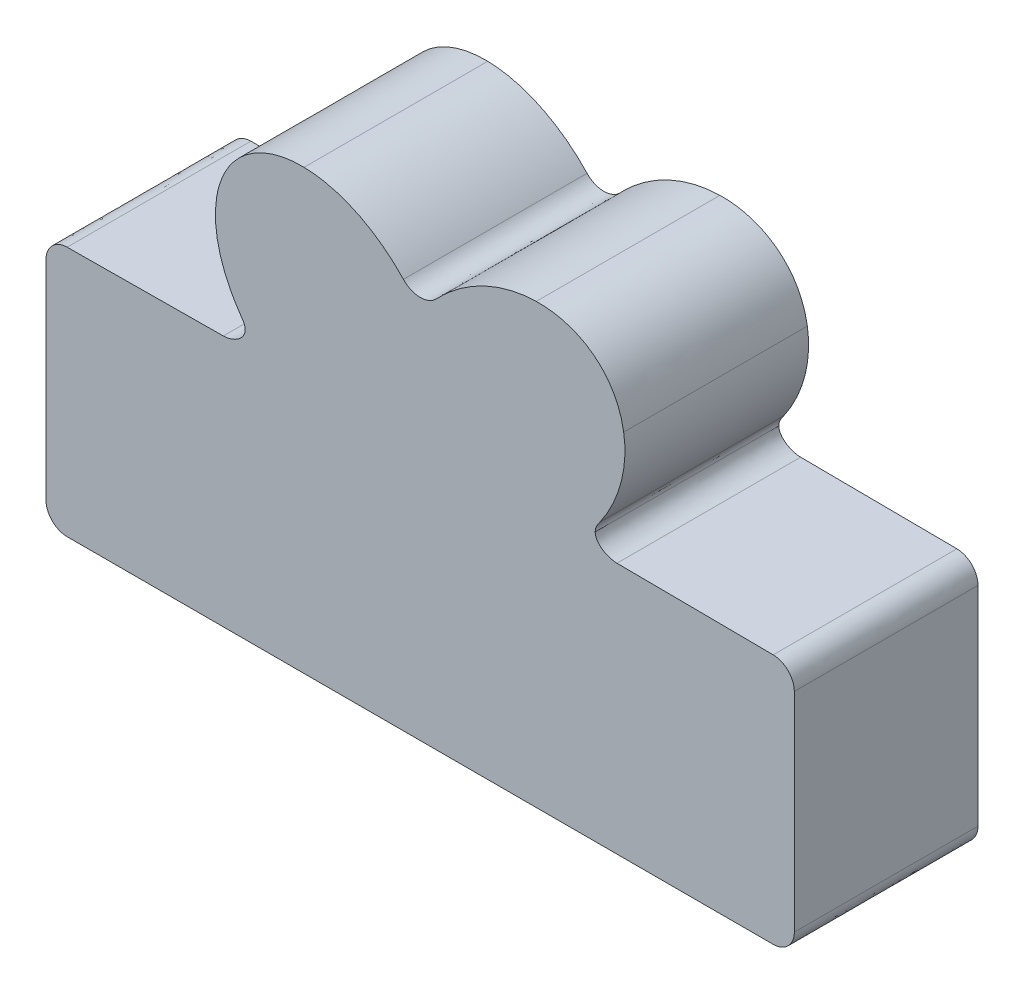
ISO-10303-21;
HEADER;
FILE_DESCRIPTION(('STEP AP214'),'2;1');
FILE_NAME('part.step','',(''),(''),'','','');
FILE_SCHEMA(('AUTOMOTIVE_DESIGN { 1 0 10303 214 1 1 1 1 }'));
ENDSEC;
DATA;
#1=APPLICATION_CONTEXT('core data for automotive mechanical design processes');
#2=APPLICATION_PROTOCOL_DEFINITION('international standard','automotive_design',2000,#1);
#3=PRODUCT_CONTEXT('',#1,'mechanical');
#4=PRODUCT('Part','Part','',(#3));
#5=PRODUCT_RELATED_PRODUCT_CATEGORY('part','',(#4));
#6=PRODUCT_DEFINITION_FORMATION('','',#4);
#7=PRODUCT_DEFINITION_CONTEXT('part definition',#1,'design');
#8=PRODUCT_DEFINITION('design','',#6,#7);
#9=PRODUCT_DEFINITION_SHAPE('','',#8);
#10=(LENGTH_UNIT() NAMED_UNIT(*) SI_UNIT(.MILLI.,.METRE.));
#11=(NAMED_UNIT(*) PLANE_ANGLE_UNIT() SI_UNIT($,.RADIAN.));
#12=(NAMED_UNIT(*) SI_UNIT($,.STERADIAN.) SOLID_ANGLE_UNIT());
#13=UNCERTAINTY_MEASURE_WITH_UNIT(LENGTH_MEASURE(1.E-05),#10,'distance_accuracy_value','');
#14=(GEOMETRIC_REPRESENTATION_CONTEXT(3) GLOBAL_UNCERTAINTY_ASSIGNED_CONTEXT((#13)) GLOBAL_UNIT_ASSIGNED_CONTEXT((#10,
#11,#12)) REPRESENTATION_CONTEXT('',''));
#15=CARTESIAN_POINT('',(0.,0.,0.));
#16=DIRECTION('',(0.,0.,1.));
#17=DIRECTION('',(1.,0.,0.));
#18=AXIS2_PLACEMENT_3D('',#15,#16,#17);
#19=CARTESIAN_POINT('',(569.775998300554,314.705898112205,8.));
#20=CARTESIAN_POINT('',(569.467398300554,316.625398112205,8.));
#21=CARTESIAN_POINT('',(567.892498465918,317.773697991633,8.));
#22=CARTESIAN_POINT('',(565.96789870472,317.733798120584,8.));
#23=B_SPLINE_CURVE_WITH_KNOTS('',3,(#19,#20,#21,#22),.UNSPECIFIED.,.F.,.F.,(4,4),
(0.904761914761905,1.),.UNSPECIFIED.);
#24=DIRECTION('',(0.,0.,-1.));
#25=VECTOR('',#24,1.);
#26=SURFACE_OF_LINEAR_EXTRUSION('',#23,#25);
#27=CARTESIAN_POINT('',(569.775998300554,314.705898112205,0.));
#28=CARTESIAN_POINT('',(569.467398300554,316.625398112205,0.));
#29=CARTESIAN_POINT('',(567.892498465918,317.773697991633,0.));
#30=CARTESIAN_POINT('',(565.96789870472,317.733798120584,0.));
#31=B_SPLINE_CURVE_WITH_KNOTS('',3,(#27,#28,#29,#30),.UNSPECIFIED.,.F.,.F.,(4,4),
(0.904761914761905,1.),.UNSPECIFIED.);
#32=CARTESIAN_POINT('',(569.775998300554,314.705898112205,0.));
#33=VERTEX_POINT('',#32);
#34=CARTESIAN_POINT('',(565.96789870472,317.733798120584,0.));
#35=VERTEX_POINT('',#34);
#36=EDGE_CURVE('E407',#33,#35,#31,.T.);
#37=ORIENTED_EDGE('',*,*,#36,.T.);
#38=DIRECTION('',(0.,0.,-1.));
#39=VECTOR('',#38,1.);
#40=CARTESIAN_POINT('',(565.96789870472,317.733798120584,8.));
#41=LINE('',#40,#39);
#42=CARTESIAN_POINT('',(565.96789870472,317.733798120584,8.));
#43=VERTEX_POINT('',#42);
#44=EDGE_CURVE('E11',#43,#35,#41,.T.);
#45=ORIENTED_EDGE('',*,*,#44,.F.);
#46=CARTESIAN_POINT('',(569.775998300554,314.705898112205,8.));
#47=VERTEX_POINT('',#46);
#48=EDGE_CURVE('E383',#47,#43,#23,.T.);
#49=ORIENTED_EDGE('',*,*,#48,.F.);
#50=DIRECTION('',(0.,0.,-1.));
#51=VECTOR('',#50,1.);
#52=CARTESIAN_POINT('',(569.775998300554,314.705898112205,8.));
#53=LINE('',#52,#51);
#54=EDGE_CURVE('E200',#47,#33,#53,.T.);
#55=ORIENTED_EDGE('',*,*,#54,.T.);
#56=EDGE_LOOP('',(#37,#45,#49,#55));
#57=FACE_BOUND('',#56,.T.);
#58=ADVANCED_FACE('F35',(#57),#26,.F.);
#59=CARTESIAN_POINT('',(565.96789870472,317.733798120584,8.));
#60=CARTESIAN_POINT('',(564.32079870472,317.699698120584,8.));
#61=CARTESIAN_POINT('',(562.752599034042,316.857598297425,8.));
#62=CARTESIAN_POINT('',(561.64059917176,315.673098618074,8.));
#63=B_SPLINE_CURVE_WITH_KNOTS('',3,(#59,#60,#61,#62),.UNSPECIFIED.,.F.,.F.,(4,4),
(0.857142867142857,0.904761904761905),.UNSPECIFIED.);
#64=DIRECTION('',(0.,0.,-1.));
#65=VECTOR('',#64,1.);
#66=SURFACE_OF_LINEAR_EXTRUSION('',#63,#65);
#67=CARTESIAN_POINT('',(565.96789870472,317.733798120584,0.));
#68=CARTESIAN_POINT('',(564.32079870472,317.699698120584,0.));
#69=CARTESIAN_POINT('',(562.752599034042,316.857598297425,0.));
#70=CARTESIAN_POINT('',(561.64059917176,315.673098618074,0.));
#71=B_SPLINE_CURVE_WITH_KNOTS('',3,(#67,#68,#69,#70),.UNSPECIFIED.,.F.,.F.,(4,4),
(0.857142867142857,0.904761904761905),.UNSPECIFIED.);
#72=CARTESIAN_POINT('',(561.64059917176,315.673098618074,0.));
#73=VERTEX_POINT('',#72);
#74=EDGE_CURVE('E398',#35,#73,#71,.T.);
#75=ORIENTED_EDGE('',*,*,#74,.T.);
#76=DIRECTION('',(0.,0.,-1.));
#77=VECTOR('',#76,1.);
#78=CARTESIAN_POINT('',(561.64059917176,315.673098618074,8.));
#79=LINE('',#78,#77);
#80=CARTESIAN_POINT('',(561.64059917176,315.673098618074,8.));
#81=VERTEX_POINT('',#80);
#82=EDGE_CURVE('E44',#81,#73,#79,.T.);
#83=ORIENTED_EDGE('',*,*,#82,.F.);
#84=EDGE_CURVE('E131',#43,#81,#63,.T.);
#85=ORIENTED_EDGE('',*,*,#84,.F.);
#86=ORIENTED_EDGE('',*,*,#44,.T.);
#87=EDGE_LOOP('',(#75,#83,#85,#86));
#88=FACE_BOUND('',#87,.T.);
#89=ADVANCED_FACE('F390',(#88),#66,.F.);
#90=CARTESIAN_POINT('',(561.64059917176,315.673098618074,8.));
#91=CARTESIAN_POINT('',(561.24549917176,315.251798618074,8.));
#92=CARTESIAN_POINT('',(560.577099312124,315.251798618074,8.));
#93=CARTESIAN_POINT('',(560.181999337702,315.673098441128,8.));
#94=B_SPLINE_CURVE_WITH_KNOTS('',3,(#90,#91,#92,#93),.UNSPECIFIED.,.F.,.F.,(4,4),
(0.80952381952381,0.857142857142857),.UNSPECIFIED.);
#95=DIRECTION('',(0.,0.,-1.));
#96=VECTOR('',#95,1.);
#97=SURFACE_OF_LINEAR_EXTRUSION('',#94,#96);
#98=CARTESIAN_POINT('',(561.64059917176,315.673098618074,0.));
#99=CARTESIAN_POINT('',(561.24549917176,315.251798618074,0.));
#100=CARTESIAN_POINT('',(560.577099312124,315.251798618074,0.));
#101=CARTESIAN_POINT('',(560.181999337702,315.673098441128,0.));
#102=B_SPLINE_CURVE_WITH_KNOTS('',3,(#98,#99,#100,#101),.UNSPECIFIED.,.F.,.F.,(4,4),
(0.80952381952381,0.857142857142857),.UNSPECIFIED.);
#103=CARTESIAN_POINT('',(560.181999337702,315.673098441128,0.));
#104=VERTEX_POINT('',#103);
#105=EDGE_CURVE('E406',#73,#104,#102,.T.);
#106=ORIENTED_EDGE('',*,*,#105,.T.);
#107=DIRECTION('',(0.,0.,-1.));
#108=VECTOR('',#107,1.);
#109=CARTESIAN_POINT('',(560.181999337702,315.673098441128,8.));
#110=LINE('',#109,#108);
#111=CARTESIAN_POINT('',(560.181999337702,315.673098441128,8.));
#112=VERTEX_POINT('',#111);
#113=EDGE_CURVE('E411',#112,#104,#110,.T.);
#114=ORIENTED_EDGE('',*,*,#113,.F.);
#115=EDGE_CURVE('E369',#81,#112,#94,.T.);
#116=ORIENTED_EDGE('',*,*,#115,.F.);
#117=ORIENTED_EDGE('',*,*,#82,.T.);
#118=EDGE_LOOP('',(#106,#114,#116,#117));
#119=FACE_BOUND('',#118,.T.);
#120=ADVANCED_FACE('F362',(#119),#97,.F.);
#121=CARTESIAN_POINT('',(560.181999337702,315.673098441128,8.));
#122=CARTESIAN_POINT('',(559.069999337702,316.857598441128,8.));
#123=CARTESIAN_POINT('',(557.501799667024,317.699698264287,8.));
#124=CARTESIAN_POINT('',(555.854700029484,317.733798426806,8.));
#125=B_SPLINE_CURVE_WITH_KNOTS('',3,(#121,#122,#123,#124),.UNSPECIFIED.,.F.,.F.,(4,4),
(0.761904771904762,0.80952380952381),.UNSPECIFIED.);
#126=DIRECTION('',(0.,0.,-1.));
#127=VECTOR('',#126,1.);
#128=SURFACE_OF_LINEAR_EXTRUSION('',#125,#127);
#129=CARTESIAN_POINT('',(560.181999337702,315.673098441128,0.));
#130=CARTESIAN_POINT('',(559.069999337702,316.857598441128,0.));
#131=CARTESIAN_POINT('',(557.501799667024,317.699698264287,0.));
#132=CARTESIAN_POINT('',(555.854700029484,317.733798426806,0.));
#133=B_SPLINE_CURVE_WITH_KNOTS('',3,(#129,#130,#131,#132),.UNSPECIFIED.,.F.,.F.,(4,4),
(0.761904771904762,0.80952380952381),.UNSPECIFIED.);
#134=CARTESIAN_POINT('',(555.854700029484,317.733798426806,0.));
#135=VERTEX_POINT('',#134);
#136=EDGE_CURVE('E415',#104,#135,#133,.T.);
#137=ORIENTED_EDGE('',*,*,#136,.T.);
#138=DIRECTION('',(0.,0.,-1.));
#139=VECTOR('',#138,1.);
#140=CARTESIAN_POINT('',(555.854700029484,317.733798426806,8.));
#141=LINE('',#140,#139);
#142=CARTESIAN_POINT('',(555.854700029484,317.733798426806,8.));
#143=VERTEX_POINT('',#142);
#144=EDGE_CURVE('E579',#143,#135,#141,.T.);
#145=ORIENTED_EDGE('',*,*,#144,.F.);
#146=EDGE_CURVE('E365',#112,#143,#125,.T.);
#147=ORIENTED_EDGE('',*,*,#146,.F.);
#148=ORIENTED_EDGE('',*,*,#113,.T.);
#149=EDGE_LOOP('',(#137,#145,#147,#148));
#150=FACE_BOUND('',#149,.T.);
#151=ADVANCED_FACE('F358',(#150),#128,.F.);
#152=CARTESIAN_POINT('',(555.854700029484,317.733798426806,8.));
#153=CARTESIAN_POINT('',(553.930100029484,317.773698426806,8.));
#154=CARTESIAN_POINT('',(552.355200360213,316.625398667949,8.));
#155=CARTESIAN_POINT('',(552.046600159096,314.705899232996,8.));
#156=B_SPLINE_CURVE_WITH_KNOTS('',3,(#152,#153,#154,#155),.UNSPECIFIED.,.F.,.F.,(4,4),
(0.714285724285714,0.761904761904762),.UNSPECIFIED.);
#157=DIRECTION('',(0.,0.,-1.));
#158=VECTOR('',#157,1.);
#159=SURFACE_OF_LINEAR_EXTRUSION('',#156,#158);
#160=CARTESIAN_POINT('',(555.854700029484,317.733798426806,0.));
#161=CARTESIAN_POINT('',(553.930100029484,317.773698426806,0.));
#162=CARTESIAN_POINT('',(552.355200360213,316.625398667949,0.));
#163=CARTESIAN_POINT('',(552.046600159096,314.705899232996,0.));
#164=B_SPLINE_CURVE_WITH_KNOTS('',3,(#160,#161,#162,#163),.UNSPECIFIED.,.F.,.F.,(4,4),
(0.714285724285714,0.761904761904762),.UNSPECIFIED.);
#165=CARTESIAN_POINT('',(552.046600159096,314.705899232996,0.));
#166=VERTEX_POINT('',#165);
#167=EDGE_CURVE('E417',#135,#166,#164,.T.);
#168=ORIENTED_EDGE('',*,*,#167,.T.);
#169=DIRECTION('',(0.,0.,-1.));
#170=VECTOR('',#169,1.);
#171=CARTESIAN_POINT('',(552.046600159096,314.705899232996,8.));
#172=LINE('',#171,#170);
#173=CARTESIAN_POINT('',(552.046600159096,314.705899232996,8.));
#174=VERTEX_POINT('',#173);
#175=EDGE_CURVE('E576',#174,#166,#172,.T.);
#176=ORIENTED_EDGE('',*,*,#175,.F.);
#177=EDGE_CURVE('E343',#143,#174,#156,.T.);
#178=ORIENTED_EDGE('',*,*,#177,.F.);
#179=ORIENTED_EDGE('',*,*,#144,.T.);
#180=EDGE_LOOP('',(#168,#176,#178,#179));
#181=FACE_BOUND('',#180,.T.);
#182=ADVANCED_FACE('F354',(#181),#159,.F.);
#183=CARTESIAN_POINT('',(552.046600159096,314.705899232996,8.));
#184=CARTESIAN_POINT('',(551.826200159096,313.334899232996,8.));
#185=CARTESIAN_POINT('',(552.296700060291,311.915599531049,8.));
#186=CARTESIAN_POINT('',(553.081599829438,310.79589970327,8.));
#187=B_SPLINE_CURVE_WITH_KNOTS('',3,(#183,#184,#185,#186),.UNSPECIFIED.,.F.,.F.,(4,4),
(0.666666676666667,0.714285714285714),.UNSPECIFIED.);
#188=DIRECTION('',(0.,0.,-1.));
#189=VECTOR('',#188,1.);
#190=SURFACE_OF_LINEAR_EXTRUSION('',#187,#189);
#191=CARTESIAN_POINT('',(552.046600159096,314.705899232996,0.));
#192=CARTESIAN_POINT('',(551.826200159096,313.334899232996,0.));
#193=CARTESIAN_POINT('',(552.296700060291,311.915599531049,0.));
#194=CARTESIAN_POINT('',(553.081599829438,310.79589970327,0.));
#195=B_SPLINE_CURVE_WITH_KNOTS('',3,(#191,#192,#193,#194),.UNSPECIFIED.,.F.,.F.,(4,4),
(0.666666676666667,0.714285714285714),.UNSPECIFIED.);
#196=CARTESIAN_POINT('',(553.081599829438,310.79589970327,0.));
#197=VERTEX_POINT('',#196);
#198=EDGE_CURVE('E435',#166,#197,#195,.T.);
#199=ORIENTED_EDGE('',*,*,#198,.T.);
#200=DIRECTION('',(0.,0.,-1.));
#201=VECTOR('',#200,1.);
#202=CARTESIAN_POINT('',(553.081599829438,310.79589970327,8.));
#203=LINE('',#202,#201);
#204=CARTESIAN_POINT('',(553.081599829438,310.79589970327,8.));
#205=VERTEX_POINT('',#204);
#206=EDGE_CURVE('E573',#205,#197,#203,.T.);
#207=ORIENTED_EDGE('',*,*,#206,.F.);
#208=EDGE_CURVE('E335',#174,#205,#187,.T.);
#209=ORIENTED_EDGE('',*,*,#208,.F.);
#210=ORIENTED_EDGE('',*,*,#175,.T.);
#211=EDGE_LOOP('',(#199,#207,#209,#210));
#212=FACE_BOUND('',#211,.T.);
#213=ADVANCED_FACE('F351',(#212),#190,.F.);
#214=CARTESIAN_POINT('',(553.081599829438,310.79589970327,8.));
#215=CARTESIAN_POINT('',(553.187999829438,310.64399970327,8.));
#216=CARTESIAN_POINT('',(553.288499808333,310.51899972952,8.));
#217=CARTESIAN_POINT('',(553.287499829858,310.321799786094,8.));
#218=B_SPLINE_CURVE_WITH_KNOTS('',3,(#214,#215,#216,#217),.UNSPECIFIED.,.F.,.F.,(4,4),
(0.619047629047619,0.666666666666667),.UNSPECIFIED.);
#219=DIRECTION('',(0.,0.,-1.));
#220=VECTOR('',#219,1.);
#221=SURFACE_OF_LINEAR_EXTRUSION('',#218,#220);
#222=CARTESIAN_POINT('',(553.081599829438,310.79589970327,0.));
#223=CARTESIAN_POINT('',(553.187999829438,310.64399970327,0.));
#224=CARTESIAN_POINT('',(553.288499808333,310.51899972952,0.));
#225=CARTESIAN_POINT('',(553.287499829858,310.321799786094,0.));
#226=B_SPLINE_CURVE_WITH_KNOTS('',3,(#222,#223,#224,#225),.UNSPECIFIED.,.F.,.F.,(4,4),
(0.619047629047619,0.666666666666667),.UNSPECIFIED.);
#227=CARTESIAN_POINT('',(553.287499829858,310.321799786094,0.));
#228=VERTEX_POINT('',#227);
#229=EDGE_CURVE('E442',#197,#228,#226,.T.);
#230=ORIENTED_EDGE('',*,*,#229,.T.);
#231=DIRECTION('',(0.,0.,-1.));
#232=VECTOR('',#231,1.);
#233=CARTESIAN_POINT('',(553.287499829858,310.321799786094,8.));
#234=LINE('',#233,#232);
#235=CARTESIAN_POINT('',(553.287499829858,310.321799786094,8.));
#236=VERTEX_POINT('',#235);
#237=EDGE_CURVE('E570',#236,#228,#234,.T.);
#238=ORIENTED_EDGE('',*,*,#237,.F.);
#239=EDGE_CURVE('E327',#205,#236,#218,.T.);
#240=ORIENTED_EDGE('',*,*,#239,.F.);
#241=ORIENTED_EDGE('',*,*,#206,.T.);
#242=EDGE_LOOP('',(#230,#238,#240,#241));
#243=FACE_BOUND('',#242,.T.);
#244=ADVANCED_FACE('F319',(#243),#221,.F.);
#245=CARTESIAN_POINT('',(553.287499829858,310.321799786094,8.));
#246=CARTESIAN_POINT('',(553.285099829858,309.902299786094,8.));
#247=CARTESIAN_POINT('',(552.744599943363,309.617599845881,8.));
#248=CARTESIAN_POINT('',(552.3395,309.614599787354,8.));
#249=B_SPLINE_CURVE_WITH_KNOTS('',3,(#245,#246,#247,#248),.UNSPECIFIED.,.F.,.F.,(4,4),
(0.571428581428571,0.619047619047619),.UNSPECIFIED.);
#250=DIRECTION('',(0.,0.,-1.));
#251=VECTOR('',#250,1.);
#252=SURFACE_OF_LINEAR_EXTRUSION('',#249,#251);
#253=CARTESIAN_POINT('',(553.287499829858,310.321799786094,0.));
#254=CARTESIAN_POINT('',(553.285099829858,309.902299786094,0.));
#255=CARTESIAN_POINT('',(552.744599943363,309.617599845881,0.));
#256=CARTESIAN_POINT('',(552.3395,309.614599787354,0.));
#257=B_SPLINE_CURVE_WITH_KNOTS('',3,(#253,#254,#255,#256),.UNSPECIFIED.,.F.,.F.,(4,4),
(0.571428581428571,0.619047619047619),.UNSPECIFIED.);
#258=CARTESIAN_POINT('',(552.3395,309.614599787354,0.));
#259=VERTEX_POINT('',#258);
#260=EDGE_CURVE('E449',#228,#259,#257,.T.);
#261=ORIENTED_EDGE('',*,*,#260,.T.);
#262=DIRECTION('',(0.,0.,-1.));
#263=VECTOR('',#262,1.);
#264=CARTESIAN_POINT('',(552.3395,309.614599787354,8.));
#265=LINE('',#264,#263);
#266=CARTESIAN_POINT('',(552.3395,309.614599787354,8.));
#267=VERTEX_POINT('',#266);
#268=EDGE_CURVE('E567',#267,#259,#265,.T.);
#269=ORIENTED_EDGE('',*,*,#268,.F.);
#270=EDGE_CURVE('E323',#236,#267,#249,.T.);
#271=ORIENTED_EDGE('',*,*,#270,.F.);
#272=ORIENTED_EDGE('',*,*,#237,.T.);
#273=EDGE_LOOP('',(#261,#269,#271,#272));
#274=FACE_BOUND('',#273,.T.);
#275=ADVANCED_FACE('F315',(#274),#252,.F.);
#276=CARTESIAN_POINT('',(552.3395,309.614599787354,8.));
#277=DIRECTION('',(0.0077741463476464,-0.999969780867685,0.));
#278=DIRECTION('',(0.999969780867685,0.0077741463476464,0.));
#279=AXIS2_PLACEMENT_3D('',#276,#277,#278);
#280=PLANE('',#279);
#281=CARTESIAN_POINT('',(552.3395,309.614599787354,0.));
#282=CARTESIAN_POINT('',(545.535101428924,309.561699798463,0.));
#283=CARTESIAN_POINT('',(545.5351,309.561699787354,0.));
#284=B_SPLINE_CURVE_WITH_KNOTS('',2,(#281,#282,#283),.UNSPECIFIED.,.F.,.F.,(3,3),
(0.523809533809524,0.571428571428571),.UNSPECIFIED.);
#285=CARTESIAN_POINT('',(545.5351,309.561699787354,0.));
#286=VERTEX_POINT('',#285);
#287=EDGE_CURVE('E456',#259,#286,#284,.T.);
#288=ORIENTED_EDGE('',*,*,#287,.T.);
#289=DIRECTION('',(0.,0.,-1.));
#290=VECTOR('',#289,1.);
#291=CARTESIAN_POINT('',(545.5351,309.561699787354,8.));
#292=LINE('',#291,#290);
#293=CARTESIAN_POINT('',(545.5351,309.561699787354,8.));
#294=VERTEX_POINT('',#293);
#295=EDGE_CURVE('E564',#294,#286,#292,.T.);
#296=ORIENTED_EDGE('',*,*,#295,.F.);
#297=CARTESIAN_POINT('',(552.3395,309.614599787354,8.));
#298=CARTESIAN_POINT('',(545.535101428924,309.561699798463,8.));
#299=CARTESIAN_POINT('',(545.5351,309.561699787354,8.));
#300=B_SPLINE_CURVE_WITH_KNOTS('',2,(#297,#298,#299),.UNSPECIFIED.,.F.,.F.,(3,3),
(0.523809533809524,0.571428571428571),.UNSPECIFIED.);
#301=EDGE_CURVE('E301',#267,#294,#300,.T.);
#302=ORIENTED_EDGE('',*,*,#301,.F.);
#303=ORIENTED_EDGE('',*,*,#268,.T.);
#304=EDGE_LOOP('',(#288,#296,#302,#303));
#305=FACE_BOUND('',#304,.T.);
#306=ADVANCED_FACE('F311',(#305),#280,.F.);
#307=CARTESIAN_POINT('',(545.5351,309.561699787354,8.));
#308=CARTESIAN_POINT('',(545.0288,309.557899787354,8.));
#309=CARTESIAN_POINT('',(544.614200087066,309.147099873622,8.));
#310=CARTESIAN_POINT('',(544.6142,308.6408,8.));
#311=B_SPLINE_CURVE_WITH_KNOTS('',3,(#307,#308,#309,#310),.UNSPECIFIED.,.F.,.F.,(4,4),
(0.476190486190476,0.523809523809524),.UNSPECIFIED.);
#312=DIRECTION('',(0.,0.,-1.));
#313=VECTOR('',#312,1.);
#314=SURFACE_OF_LINEAR_EXTRUSION('',#311,#313);
#315=CARTESIAN_POINT('',(545.5351,309.561699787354,0.));
#316=CARTESIAN_POINT('',(545.0288,309.557899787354,0.));
#317=CARTESIAN_POINT('',(544.614200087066,309.147099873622,0.));
#318=CARTESIAN_POINT('',(544.6142,308.6408,0.));
#319=B_SPLINE_CURVE_WITH_KNOTS('',3,(#315,#316,#317,#318),.UNSPECIFIED.,.F.,.F.,(4,4),
(0.476190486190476,0.523809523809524),.UNSPECIFIED.);
#320=CARTESIAN_POINT('',(544.6142,308.6408,0.));
#321=VERTEX_POINT('',#320);
#322=EDGE_CURVE('E463',#286,#321,#319,.T.);
#323=ORIENTED_EDGE('',*,*,#322,.T.);
#324=DIRECTION('',(0.,0.,-1.));
#325=VECTOR('',#324,1.);
#326=CARTESIAN_POINT('',(544.6142,308.6408,8.));
#327=LINE('',#326,#325);
#328=CARTESIAN_POINT('',(544.6142,308.6408,8.));
#329=VERTEX_POINT('',#328);
#330=EDGE_CURVE('E561',#329,#321,#327,.T.);
#331=ORIENTED_EDGE('',*,*,#330,.F.);
#332=EDGE_CURVE('E293',#294,#329,#311,.T.);
#333=ORIENTED_EDGE('',*,*,#332,.F.);
#334=ORIENTED_EDGE('',*,*,#295,.T.);
#335=EDGE_LOOP('',(#323,#331,#333,#334));
#336=FACE_BOUND('',#335,.T.);
#337=ADVANCED_FACE('F308',(#336),#314,.F.);
#338=CARTESIAN_POINT('',(544.6142,308.6408,8.));
#339=DIRECTION('',(1.,0.,0.));
#340=DIRECTION('',(0.,0.,-1.));
#341=AXIS2_PLACEMENT_3D('',#338,#339,#340);
#342=PLANE('',#341);
#343=CARTESIAN_POINT('',(544.6142,308.6408,0.));
#344=CARTESIAN_POINT('',(544.6142,299.561701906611,0.));
#345=CARTESIAN_POINT('',(544.6142,299.5617,0.));
#346=B_SPLINE_CURVE_WITH_KNOTS('',2,(#343,#344,#345),.UNSPECIFIED.,.F.,.F.,(3,3),
(0.428571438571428,0.476190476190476),.UNSPECIFIED.);
#347=CARTESIAN_POINT('',(544.6142,299.5617,0.));
#348=VERTEX_POINT('',#347);
#349=EDGE_CURVE('E470',#321,#348,#346,.T.);
#350=ORIENTED_EDGE('',*,*,#349,.T.);
#351=DIRECTION('',(0.,0.,-1.));
#352=VECTOR('',#351,1.);
#353=CARTESIAN_POINT('',(544.6142,299.5617,8.));
#354=LINE('',#353,#352);
#355=CARTESIAN_POINT('',(544.6142,299.5617,8.));
#356=VERTEX_POINT('',#355);
#357=EDGE_CURVE('E558',#356,#348,#354,.T.);
#358=ORIENTED_EDGE('',*,*,#357,.F.);
#359=CARTESIAN_POINT('',(544.6142,308.6408,8.));
#360=CARTESIAN_POINT('',(544.6142,299.561701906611,8.));
#361=CARTESIAN_POINT('',(544.6142,299.5617,8.));
#362=B_SPLINE_CURVE_WITH_KNOTS('',2,(#359,#360,#361),.UNSPECIFIED.,.F.,.F.,(3,3),
(0.428571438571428,0.476190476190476),.UNSPECIFIED.);
#363=EDGE_CURVE('E286',#329,#356,#362,.T.);
#364=ORIENTED_EDGE('',*,*,#363,.F.);
#365=ORIENTED_EDGE('',*,*,#330,.T.);
#366=EDGE_LOOP('',(#350,#358,#364,#365));
#367=FACE_BOUND('',#366,.T.);
#368=ADVANCED_FACE('F278',(#367),#342,.F.);
#369=CARTESIAN_POINT('',(544.6142,299.5617,8.));
#370=CARTESIAN_POINT('',(544.6142,299.055400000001,8.));
#371=CARTESIAN_POINT('',(545.028599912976,298.639700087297,8.));
#372=CARTESIAN_POINT('',(545.53509978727,298.640799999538,8.));
#373=B_SPLINE_CURVE_WITH_KNOTS('',3,(#369,#370,#371,#372),.UNSPECIFIED.,.F.,.F.,(4,4),
(0.380952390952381,0.428571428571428),.UNSPECIFIED.);
#374=DIRECTION('',(0.,0.,-1.));
#375=VECTOR('',#374,1.);
#376=SURFACE_OF_LINEAR_EXTRUSION('',#373,#375);
#377=CARTESIAN_POINT('',(544.6142,299.5617,0.));
#378=CARTESIAN_POINT('',(544.6142,299.055400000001,0.));
#379=CARTESIAN_POINT('',(545.028599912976,298.639700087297,0.));
#380=CARTESIAN_POINT('',(545.53509978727,298.640799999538,0.));
#381=B_SPLINE_CURVE_WITH_KNOTS('',3,(#377,#378,#379,#380),.UNSPECIFIED.,.F.,.F.,(4,4),
(0.380952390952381,0.428571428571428),.UNSPECIFIED.);
#382=CARTESIAN_POINT('',(545.53509978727,298.640799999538,0.));
#383=VERTEX_POINT('',#382);
#384=EDGE_CURVE('E477',#348,#383,#381,.T.);
#385=ORIENTED_EDGE('',*,*,#384,.T.);
#386=DIRECTION('',(0.,0.,-1.));
#387=VECTOR('',#386,1.);
#388=CARTESIAN_POINT('',(545.53509978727,298.640799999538,8.));
#389=LINE('',#388,#387);
#390=CARTESIAN_POINT('',(545.53509978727,298.640799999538,8.));
#391=VERTEX_POINT('',#390);
#392=EDGE_CURVE('E555',#391,#383,#389,.T.);
#393=ORIENTED_EDGE('',*,*,#392,.F.);
#394=EDGE_CURVE('E281',#356,#391,#373,.T.);
#395=ORIENTED_EDGE('',*,*,#394,.F.);
#396=ORIENTED_EDGE('',*,*,#357,.T.);
#397=EDGE_LOOP('',(#385,#393,#395,#396));
#398=FACE_BOUND('',#397,.T.);
#399=ADVANCED_FACE('F274',(#398),#376,.F.);
#400=CARTESIAN_POINT('',(545.53509978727,298.640799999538,8.));
#401=DIRECTION('',(0.,1.,0.));
#402=DIRECTION('',(-1.,0.,0.));
#403=AXIS2_PLACEMENT_3D('',#400,#401,#402);
#404=PLANE('',#403);
#405=CARTESIAN_POINT('',(545.53509978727,298.640799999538,0.));
#406=CARTESIAN_POINT('',(576.287493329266,298.640799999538,0.));
#407=CARTESIAN_POINT('',(576.287499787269,298.640799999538,0.));
#408=B_SPLINE_CURVE_WITH_KNOTS('',2,(#405,#406,#407),.UNSPECIFIED.,.F.,.F.,(3,3),
(0.333333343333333,0.380952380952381),.UNSPECIFIED.);
#409=CARTESIAN_POINT('',(576.287499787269,298.640799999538,0.));
#410=VERTEX_POINT('',#409);
#411=EDGE_CURVE('E484',#383,#410,#408,.T.);
#412=ORIENTED_EDGE('',*,*,#411,.T.);
#413=DIRECTION('',(0.,0.,-1.));
#414=VECTOR('',#413,1.);
#415=CARTESIAN_POINT('',(576.287499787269,298.640799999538,8.));
#416=LINE('',#415,#414);
#417=CARTESIAN_POINT('',(576.287499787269,298.640799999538,8.));
#418=VERTEX_POINT('',#417);
#419=EDGE_CURVE('E552',#418,#410,#416,.T.);
#420=ORIENTED_EDGE('',*,*,#419,.F.);
#421=CARTESIAN_POINT('',(545.53509978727,298.640799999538,8.));
#422=CARTESIAN_POINT('',(576.287493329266,298.640799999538,8.));
#423=CARTESIAN_POINT('',(576.287499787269,298.640799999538,8.));
#424=B_SPLINE_CURVE_WITH_KNOTS('',2,(#421,#422,#423),.UNSPECIFIED.,.F.,.F.,(3,3),
(0.333333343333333,0.380952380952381),.UNSPECIFIED.);
#425=EDGE_CURVE('E260',#391,#418,#424,.T.);
#426=ORIENTED_EDGE('',*,*,#425,.F.);
#427=ORIENTED_EDGE('',*,*,#392,.T.);
#428=EDGE_LOOP('',(#412,#420,#426,#427));
#429=FACE_BOUND('',#428,.T.);
#430=ADVANCED_FACE('F270',(#429),#404,.F.);
#431=CARTESIAN_POINT('',(576.287499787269,298.640799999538,8.));
#432=CARTESIAN_POINT('',(576.793999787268,298.639699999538,8.));
#433=CARTESIAN_POINT('',(577.208399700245,299.055399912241,8.));
#434=CARTESIAN_POINT('',(577.208399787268,299.561699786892,8.));
#435=B_SPLINE_CURVE_WITH_KNOTS('',3,(#431,#432,#433,#434),.UNSPECIFIED.,.F.,.F.,(4,4),
(0.285714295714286,0.333333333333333),.UNSPECIFIED.);
#436=DIRECTION('',(0.,0.,-1.));
#437=VECTOR('',#436,1.);
#438=SURFACE_OF_LINEAR_EXTRUSION('',#435,#437);
#439=CARTESIAN_POINT('',(576.287499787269,298.640799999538,0.));
#440=CARTESIAN_POINT('',(576.793999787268,298.639699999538,0.));
#441=CARTESIAN_POINT('',(577.208399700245,299.055399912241,0.));
#442=CARTESIAN_POINT('',(577.208399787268,299.561699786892,0.));
#443=B_SPLINE_CURVE_WITH_KNOTS('',3,(#439,#440,#441,#442),.UNSPECIFIED.,.F.,.F.,(4,4),
(0.285714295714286,0.333333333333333),.UNSPECIFIED.);
#444=CARTESIAN_POINT('',(577.208399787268,299.561699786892,0.));
#445=VERTEX_POINT('',#444);
#446=EDGE_CURVE('E491',#410,#445,#443,.T.);
#447=ORIENTED_EDGE('',*,*,#446,.T.);
#448=DIRECTION('',(0.,0.,-1.));
#449=VECTOR('',#448,1.);
#450=CARTESIAN_POINT('',(577.208399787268,299.561699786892,8.));
#451=LINE('',#450,#449);
#452=CARTESIAN_POINT('',(577.208399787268,299.561699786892,8.));
#453=VERTEX_POINT('',#452);
#454=EDGE_CURVE('E549',#453,#445,#451,.T.);
#455=ORIENTED_EDGE('',*,*,#454,.F.);
#456=EDGE_CURVE('E252',#418,#453,#435,.T.);
#457=ORIENTED_EDGE('',*,*,#456,.F.);
#458=ORIENTED_EDGE('',*,*,#419,.T.);
#459=EDGE_LOOP('',(#447,#455,#457,#458));
#460=FACE_BOUND('',#459,.T.);
#461=ADVANCED_FACE('F267',(#460),#438,.F.);
#462=CARTESIAN_POINT('',(577.208399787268,299.561699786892,8.));
#463=DIRECTION('',(-1.,0.,0.));
#464=DIRECTION('',(0.,0.,1.));
#465=AXIS2_PLACEMENT_3D('',#462,#463,#464);
#466=PLANE('',#465);
#467=CARTESIAN_POINT('',(577.208399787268,299.561699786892,0.));
#468=CARTESIAN_POINT('',(577.208399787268,308.640797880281,0.));
#469=CARTESIAN_POINT('',(577.208399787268,308.640799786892,0.));
#470=B_SPLINE_CURVE_WITH_KNOTS('',2,(#467,#468,#469),.UNSPECIFIED.,.F.,.F.,(3,3),
(0.238095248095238,0.285714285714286),.UNSPECIFIED.);
#471=CARTESIAN_POINT('',(577.208399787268,308.640799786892,0.));
#472=VERTEX_POINT('',#471);
#473=EDGE_CURVE('E498',#445,#472,#470,.T.);
#474=ORIENTED_EDGE('',*,*,#473,.T.);
#475=DIRECTION('',(0.,0.,-1.));
#476=VECTOR('',#475,1.);
#477=CARTESIAN_POINT('',(577.208399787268,308.640799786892,8.));
#478=LINE('',#477,#476);
#479=CARTESIAN_POINT('',(577.208399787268,308.640799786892,8.));
#480=VERTEX_POINT('',#479);
#481=EDGE_CURVE('E546',#480,#472,#478,.T.);
#482=ORIENTED_EDGE('',*,*,#481,.F.);
#483=CARTESIAN_POINT('',(577.208399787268,299.561699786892,8.));
#484=CARTESIAN_POINT('',(577.208399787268,308.640797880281,8.));
#485=CARTESIAN_POINT('',(577.208399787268,308.640799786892,8.));
#486=B_SPLINE_CURVE_WITH_KNOTS('',2,(#483,#484,#485),.UNSPECIFIED.,.F.,.F.,(3,3),
(0.238095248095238,0.285714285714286),.UNSPECIFIED.);
#487=EDGE_CURVE('E240',#453,#480,#486,.T.);
#488=ORIENTED_EDGE('',*,*,#487,.F.);
#489=ORIENTED_EDGE('',*,*,#454,.T.);
#490=EDGE_LOOP('',(#474,#482,#488,#489));
#491=FACE_BOUND('',#490,.T.);
#492=ADVANCED_FACE('F232',(#491),#466,.F.);
#493=CARTESIAN_POINT('',(577.208399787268,308.640799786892,8.));
#494=CARTESIAN_POINT('',(577.208399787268,309.147099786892,8.));
#495=CARTESIAN_POINT('',(576.793799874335,309.557899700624,8.));
#496=CARTESIAN_POINT('',(576.287499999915,309.561699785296,8.));
#497=B_SPLINE_CURVE_WITH_KNOTS('',3,(#493,#494,#495,#496),.UNSPECIFIED.,.F.,.F.,(4,4),
(0.19047620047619,0.238095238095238),.UNSPECIFIED.);
#498=DIRECTION('',(0.,0.,-1.));
#499=VECTOR('',#498,1.);
#500=SURFACE_OF_LINEAR_EXTRUSION('',#497,#499);
#501=CARTESIAN_POINT('',(577.208399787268,308.640799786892,0.));
#502=CARTESIAN_POINT('',(577.208399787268,309.147099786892,0.));
#503=CARTESIAN_POINT('',(576.793799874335,309.557899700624,0.));
#504=CARTESIAN_POINT('',(576.287499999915,309.561699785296,0.));
#505=B_SPLINE_CURVE_WITH_KNOTS('',3,(#501,#502,#503,#504),.UNSPECIFIED.,.F.,.F.,(4,4),
(0.19047620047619,0.238095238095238),.UNSPECIFIED.);
#506=CARTESIAN_POINT('',(576.287499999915,309.561699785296,0.));
#507=VERTEX_POINT('',#506);
#508=EDGE_CURVE('E505',#472,#507,#505,.T.);
#509=ORIENTED_EDGE('',*,*,#508,.T.);
#510=DIRECTION('',(0.,0.,-1.));
#511=VECTOR('',#510,1.);
#512=CARTESIAN_POINT('',(576.287499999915,309.561699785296,8.));
#513=LINE('',#512,#511);
#514=CARTESIAN_POINT('',(576.287499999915,309.561699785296,8.));
#515=VERTEX_POINT('',#514);
#516=EDGE_CURVE('E543',#515,#507,#513,.T.);
#517=ORIENTED_EDGE('',*,*,#516,.F.);
#518=EDGE_CURVE('E235',#480,#515,#497,.T.);
#519=ORIENTED_EDGE('',*,*,#518,.F.);
#520=ORIENTED_EDGE('',*,*,#481,.T.);
#521=EDGE_LOOP('',(#509,#517,#519,#520));
#522=FACE_BOUND('',#521,.T.);
#523=ADVANCED_FACE('F227',(#522),#500,.F.);
#524=CARTESIAN_POINT('',(576.287499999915,309.561699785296,8.));
#525=DIRECTION('',(-0.0077741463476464,-0.999969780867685,0.));
#526=DIRECTION('',(0.999969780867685,-0.0077741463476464,0.));
#527=AXIS2_PLACEMENT_3D('',#524,#525,#526);
#528=PLANE('',#527);
#529=CARTESIAN_POINT('',(576.287499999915,309.561699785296,0.));
#530=CARTESIAN_POINT('',(569.483101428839,309.614599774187,0.));
#531=CARTESIAN_POINT('',(569.483099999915,309.614599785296,0.));
#532=B_SPLINE_CURVE_WITH_KNOTS('',2,(#529,#530,#531),.UNSPECIFIED.,.F.,.F.,(3,3),
(0.142857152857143,0.19047619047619),.UNSPECIFIED.);
#533=CARTESIAN_POINT('',(569.483099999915,309.614599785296,0.));
#534=VERTEX_POINT('',#533);
#535=EDGE_CURVE('E512',#507,#534,#532,.T.);
#536=ORIENTED_EDGE('',*,*,#535,.T.);
#537=DIRECTION('',(0.,0.,-1.));
#538=VECTOR('',#537,1.);
#539=CARTESIAN_POINT('',(569.483099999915,309.614599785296,8.));
#540=LINE('',#539,#538);
#541=CARTESIAN_POINT('',(569.483099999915,309.614599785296,8.));
#542=VERTEX_POINT('',#541);
#543=EDGE_CURVE('E195',#542,#534,#540,.T.);
#544=ORIENTED_EDGE('',*,*,#543,.F.);
#545=CARTESIAN_POINT('',(576.287499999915,309.561699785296,8.));
#546=CARTESIAN_POINT('',(569.483101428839,309.614599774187,8.));
#547=CARTESIAN_POINT('',(569.483099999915,309.614599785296,8.));
#548=B_SPLINE_CURVE_WITH_KNOTS('',2,(#545,#546,#547),.UNSPECIFIED.,.F.,.F.,(3,3),
(0.142857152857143,0.19047619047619),.UNSPECIFIED.);
#549=EDGE_CURVE('E186',#515,#542,#548,.T.);
#550=ORIENTED_EDGE('',*,*,#549,.F.);
#551=ORIENTED_EDGE('',*,*,#516,.T.);
#552=EDGE_LOOP('',(#536,#544,#550,#551));
#553=FACE_BOUND('',#552,.T.);
#554=ADVANCED_FACE('F224',(#553),#528,.F.);
#555=CARTESIAN_POINT('',(569.483099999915,309.614599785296,8.));
#556=CARTESIAN_POINT('',(569.077999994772,309.617599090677,8.));
#557=CARTESIAN_POINT('',(568.537499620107,309.902298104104,8.));
#558=CARTESIAN_POINT('',(568.5350987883,310.321797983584,8.));
#559=B_SPLINE_CURVE_WITH_KNOTS('',3,(#555,#556,#557,#558),.UNSPECIFIED.,.F.,.F.,(4,4),
(0.0952381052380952,0.142857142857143),.UNSPECIFIED.);
#560=DIRECTION('',(0.,0.,-1.));
#561=VECTOR('',#560,1.);
#562=SURFACE_OF_LINEAR_EXTRUSION('',#559,#561);
#563=CARTESIAN_POINT('',(569.483099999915,309.614599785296,0.));
#564=CARTESIAN_POINT('',(569.077999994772,309.617599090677,0.));
#565=CARTESIAN_POINT('',(568.537499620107,309.902298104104,0.));
#566=CARTESIAN_POINT('',(568.5350987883,310.321797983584,0.));
#567=B_SPLINE_CURVE_WITH_KNOTS('',3,(#563,#564,#565,#566),.UNSPECIFIED.,.F.,.F.,(4,4),
(0.0952381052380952,0.142857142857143),.UNSPECIFIED.);
#568=CARTESIAN_POINT('',(568.5350987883,310.321797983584,0.));
#569=VERTEX_POINT('',#568);
#570=EDGE_CURVE('E194',#534,#569,#567,.T.);
#571=ORIENTED_EDGE('',*,*,#570,.T.);
#572=DIRECTION('',(0.,0.,-1.));
#573=VECTOR('',#572,1.);
#574=CARTESIAN_POINT('',(568.5350987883,310.321797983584,8.));
#575=LINE('',#574,#573);
#576=CARTESIAN_POINT('',(568.5350987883,310.321797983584,8.));
#577=VERTEX_POINT('',#576);
#578=EDGE_CURVE('E191',#577,#569,#575,.T.);
#579=ORIENTED_EDGE('',*,*,#578,.F.);
#580=EDGE_CURVE('E180',#542,#577,#559,.T.);
#581=ORIENTED_EDGE('',*,*,#580,.F.);
#582=ORIENTED_EDGE('',*,*,#543,.T.);
#583=EDGE_LOOP('',(#571,#579,#581,#582));
#584=FACE_BOUND('',#583,.T.);
#585=ADVANCED_FACE('F192',(#584),#562,.F.);
#586=CARTESIAN_POINT('',(568.5350987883,310.321797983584,8.));
#587=CARTESIAN_POINT('',(568.534098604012,310.51899798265,8.));
#588=CARTESIAN_POINT('',(568.634598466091,310.64399805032,8.));
#589=CARTESIAN_POINT('',(568.740998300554,310.795898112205,8.));
#590=B_SPLINE_CURVE_WITH_KNOTS('',3,(#586,#587,#588,#589),.UNSPECIFIED.,.F.,.F.,(4,4),
(0.0476190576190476,0.0952380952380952),.UNSPECIFIED.);
#591=DIRECTION('',(0.,0.,-1.));
#592=VECTOR('',#591,1.);
#593=SURFACE_OF_LINEAR_EXTRUSION('',#590,#592);
#594=CARTESIAN_POINT('',(568.5350987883,310.321797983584,0.));
#595=CARTESIAN_POINT('',(568.534098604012,310.51899798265,0.));
#596=CARTESIAN_POINT('',(568.634598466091,310.64399805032,0.));
#597=CARTESIAN_POINT('',(568.740998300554,310.795898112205,0.));
#598=B_SPLINE_CURVE_WITH_KNOTS('',3,(#594,#595,#596,#597),.UNSPECIFIED.,.F.,.F.,(4,4),
(0.0476190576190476,0.0952380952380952),.UNSPECIFIED.);
#599=CARTESIAN_POINT('',(568.740998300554,310.795898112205,0.));
#600=VERTEX_POINT('',#599);
#601=EDGE_CURVE('E117',#569,#600,#598,.T.);
#602=ORIENTED_EDGE('',*,*,#601,.T.);
#603=DIRECTION('',(0.,0.,-1.));
#604=VECTOR('',#603,1.);
#605=CARTESIAN_POINT('',(568.740998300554,310.795898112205,8.));
#606=LINE('',#605,#604);
#607=CARTESIAN_POINT('',(568.740998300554,310.795898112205,8.));
#608=VERTEX_POINT('',#607);
#609=EDGE_CURVE('E196',#608,#600,#606,.T.);
#610=ORIENTED_EDGE('',*,*,#609,.F.);
#611=EDGE_CURVE('E184',#577,#608,#590,.T.);
#612=ORIENTED_EDGE('',*,*,#611,.F.);
#613=ORIENTED_EDGE('',*,*,#578,.T.);
#614=EDGE_LOOP('',(#602,#610,#612,#613));
#615=FACE_BOUND('',#614,.T.);
#616=ADVANCED_FACE('F198',(#615),#593,.F.);
#617=CARTESIAN_POINT('',(568.740998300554,310.795898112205,8.));
#618=CARTESIAN_POINT('',(569.525898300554,311.915598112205,8.));
#619=CARTESIAN_POINT('',(569.996398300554,313.334898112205,8.));
#620=CARTESIAN_POINT('',(569.775998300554,314.705898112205,8.));
#621=B_SPLINE_CURVE_WITH_KNOTS('',3,(#617,#618,#619,#620),.UNSPECIFIED.,.F.,.F.,(4,4),(0.,
0.0476190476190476),.UNSPECIFIED.);
#622=DIRECTION('',(0.,0.,-1.));
#623=VECTOR('',#622,1.);
#624=SURFACE_OF_LINEAR_EXTRUSION('',#621,#623);
#625=CARTESIAN_POINT('',(568.740998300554,310.795898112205,0.));
#626=CARTESIAN_POINT('',(569.525898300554,311.915598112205,0.));
#627=CARTESIAN_POINT('',(569.996398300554,313.334898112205,0.));
#628=CARTESIAN_POINT('',(569.775998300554,314.705898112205,0.));
#629=B_SPLINE_CURVE_WITH_KNOTS('',3,(#625,#626,#627,#628),.UNSPECIFIED.,.F.,.F.,(4,4),(0.,
0.0476190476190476),.UNSPECIFIED.);
#630=EDGE_CURVE('E123',#600,#33,#629,.T.);
#631=ORIENTED_EDGE('',*,*,#630,.T.);
#632=ORIENTED_EDGE('',*,*,#54,.F.);
#633=EDGE_CURVE('E52',#608,#47,#621,.T.);
#634=ORIENTED_EDGE('',*,*,#633,.F.);
#635=ORIENTED_EDGE('',*,*,#609,.T.);
#636=EDGE_LOOP('',(#631,#632,#634,#635));
#637=FACE_BOUND('',#636,.T.);
#638=ADVANCED_FACE('F220',(#637),#624,.F.);
#639=CARTESIAN_POINT('',(568.477948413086,316.954623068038,8.));
#640=DIRECTION('',(0.,0.,1.));
#641=DIRECTION('',(1.,0.,0.));
#642=AXIS2_PLACEMENT_3D('',#639,#640,#641);
#643=PLANE('',#642);
#644=ORIENTED_EDGE('',*,*,#48,.T.);
#645=ORIENTED_EDGE('',*,*,#84,.T.);
#646=ORIENTED_EDGE('',*,*,#115,.T.);
#647=ORIENTED_EDGE('',*,*,#146,.T.);
#648=ORIENTED_EDGE('',*,*,#177,.T.);
#649=ORIENTED_EDGE('',*,*,#208,.T.);
#650=ORIENTED_EDGE('',*,*,#239,.T.);
#651=ORIENTED_EDGE('',*,*,#270,.T.);
#652=ORIENTED_EDGE('',*,*,#301,.T.);
#653=ORIENTED_EDGE('',*,*,#332,.T.);
#654=ORIENTED_EDGE('',*,*,#363,.T.);
#655=ORIENTED_EDGE('',*,*,#394,.T.);
#656=ORIENTED_EDGE('',*,*,#425,.T.);
#657=ORIENTED_EDGE('',*,*,#456,.T.);
#658=ORIENTED_EDGE('',*,*,#487,.T.);
#659=ORIENTED_EDGE('',*,*,#518,.T.);
#660=ORIENTED_EDGE('',*,*,#549,.T.);
#661=ORIENTED_EDGE('',*,*,#580,.T.);
#662=ORIENTED_EDGE('',*,*,#611,.T.);
#663=ORIENTED_EDGE('',*,*,#633,.T.);
#664=EDGE_LOOP('',(#644,#645,#646,#647,#648,#649,#650,#651,#652,#653,#654,#655,#656,#657,#658,
#659,#660,#661,#662,#663));
#665=FACE_BOUND('',#664,.T.);
#666=ADVANCED_FACE('F182',(#665),#643,.T.);
#667=CARTESIAN_POINT('',(568.477948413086,316.954623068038,0.));
#668=DIRECTION('',(0.,0.,1.));
#669=DIRECTION('',(1.,0.,0.));
#670=AXIS2_PLACEMENT_3D('',#667,#668,#669);
#671=PLANE('',#670);
#672=ORIENTED_EDGE('',*,*,#36,.F.);
#673=ORIENTED_EDGE('',*,*,#630,.F.);
#674=ORIENTED_EDGE('',*,*,#601,.F.);
#675=ORIENTED_EDGE('',*,*,#570,.F.);
#676=ORIENTED_EDGE('',*,*,#535,.F.);
#677=ORIENTED_EDGE('',*,*,#508,.F.);
#678=ORIENTED_EDGE('',*,*,#473,.F.);
#679=ORIENTED_EDGE('',*,*,#446,.F.);
#680=ORIENTED_EDGE('',*,*,#411,.F.);
#681=ORIENTED_EDGE('',*,*,#384,.F.);
#682=ORIENTED_EDGE('',*,*,#349,.F.);
#683=ORIENTED_EDGE('',*,*,#322,.F.);
#684=ORIENTED_EDGE('',*,*,#287,.F.);
#685=ORIENTED_EDGE('',*,*,#260,.F.);
#686=ORIENTED_EDGE('',*,*,#229,.F.);
#687=ORIENTED_EDGE('',*,*,#198,.F.);
#688=ORIENTED_EDGE('',*,*,#167,.F.);
#689=ORIENTED_EDGE('',*,*,#136,.F.);
#690=ORIENTED_EDGE('',*,*,#105,.F.);
#691=ORIENTED_EDGE('',*,*,#74,.F.);
#692=EDGE_LOOP('',(#672,#673,#674,#675,#676,#677,#678,#679,#680,#681,#682,#683,#684,#685,#686,
#687,#688,#689,#690,#691));
#693=FACE_BOUND('',#692,.T.);
#694=ADVANCED_FACE('F413',(#693),#671,.F.);
#695=CLOSED_SHELL('',(#58,#89,#120,#151,#182,#213,#244,#275,#306,#337,#368,#399,#430,#461,#492,
#523,#554,#585,#616,#638,#666,#694));
#696=MANIFOLD_SOLID_BREP('B2',#695);
#697=ADVANCED_BREP_SHAPE_REPRESENTATION('',(#18,#696),#14);
#698=SHAPE_DEFINITION_REPRESENTATION(#9,#697);
ENDSEC;
END-ISO-10303-21;
